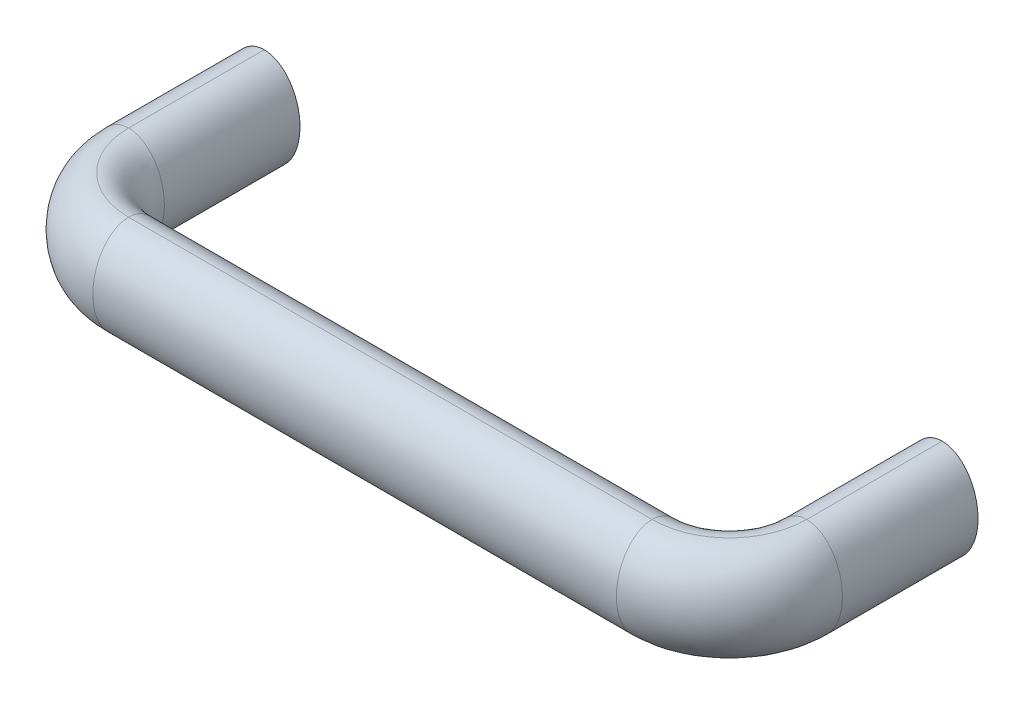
ISO-10303-21;
HEADER;
FILE_DESCRIPTION(('STEP AP214'),'2;1');
FILE_NAME('part.step','',(''),(''),'','','');
FILE_SCHEMA(('AUTOMOTIVE_DESIGN { 1 0 10303 214 1 1 1 1 }'));
ENDSEC;
DATA;
#1=APPLICATION_CONTEXT('core data for automotive mechanical design processes');
#2=APPLICATION_PROTOCOL_DEFINITION('international standard','automotive_design',2000,#1);
#3=PRODUCT_CONTEXT('',#1,'mechanical');
#4=PRODUCT('Part','Part','',(#3));
#5=PRODUCT_RELATED_PRODUCT_CATEGORY('part','',(#4));
#6=PRODUCT_DEFINITION_FORMATION('','',#4);
#7=PRODUCT_DEFINITION_CONTEXT('part definition',#1,'design');
#8=PRODUCT_DEFINITION('design','',#6,#7);
#9=PRODUCT_DEFINITION_SHAPE('','',#8);
#10=(LENGTH_UNIT() NAMED_UNIT(*) SI_UNIT(.MILLI.,.METRE.));
#11=(NAMED_UNIT(*) PLANE_ANGLE_UNIT() SI_UNIT($,.RADIAN.));
#12=(NAMED_UNIT(*) SI_UNIT($,.STERADIAN.) SOLID_ANGLE_UNIT());
#13=UNCERTAINTY_MEASURE_WITH_UNIT(LENGTH_MEASURE(1.E-05),#10,'distance_accuracy_value','');
#14=(GEOMETRIC_REPRESENTATION_CONTEXT(3) GLOBAL_UNCERTAINTY_ASSIGNED_CONTEXT((#13)) GLOBAL_UNIT_ASSIGNED_CONTEXT((#10,
#11,#12)) REPRESENTATION_CONTEXT('',''));
#15=CARTESIAN_POINT('',(0.,0.,0.));
#16=DIRECTION('',(0.,0.,1.));
#17=DIRECTION('',(1.,0.,0.));
#18=AXIS2_PLACEMENT_3D('',#15,#16,#17);
#19=CARTESIAN_POINT('',(0.,0.,0.));
#20=DIRECTION('',(0.,0.,-1.));
#21=DIRECTION('',(0.,1.,0.));
#22=AXIS2_PLACEMENT_3D('',#19,#20,#21);
#23=CONICAL_SURFACE('',#22,3.24999999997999,0.785398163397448);
#24=CARTESIAN_POINT('',(0.,0.,0.249999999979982));
#25=DIRECTION('',(0.,0.,-1.));
#26=DIRECTION('',(0.,1.,0.));
#27=AXIS2_PLACEMENT_3D('',#24,#25,#26);
#28=CIRCLE('',#27,3.);
#29=CARTESIAN_POINT('',(0.,3.,0.249999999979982));
#30=VERTEX_POINT('',#29);
#31=EDGE_CURVE('E17',#30,#30,#28,.F.);
#32=ORIENTED_EDGE('',*,*,#31,.T.);
#33=EDGE_LOOP('',(#32));
#34=FACE_BOUND('',#33,.T.);
#35=CARTESIAN_POINT('',(0.,0.,0.));
#36=DIRECTION('',(0.,0.,-1.));
#37=DIRECTION('',(0.,1.,0.));
#38=AXIS2_PLACEMENT_3D('',#35,#36,#37);
#39=CIRCLE('',#38,3.24999999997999);
#40=CARTESIAN_POINT('',(0.,3.24999999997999,0.));
#41=VERTEX_POINT('',#40);
#42=EDGE_CURVE('E153',#41,#41,#39,.T.);
#43=ORIENTED_EDGE('',*,*,#42,.T.);
#44=EDGE_LOOP('',(#43));
#45=FACE_BOUND('',#44,.T.);
#46=ADVANCED_FACE('F14',(#34,#45),#23,.F.);
#47=CARTESIAN_POINT('',(180.,0.,0.));
#48=DIRECTION('',(0.,0.,-1.));
#49=DIRECTION('',(0.,1.,0.));
#50=AXIS2_PLACEMENT_3D('',#47,#48,#49);
#51=CONICAL_SURFACE('',#50,3.24999999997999,0.785398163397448);
#52=CARTESIAN_POINT('',(180.,0.,0.249999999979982));
#53=DIRECTION('',(0.,0.,-1.));
#54=DIRECTION('',(0.,1.,0.));
#55=AXIS2_PLACEMENT_3D('',#52,#53,#54);
#56=CIRCLE('',#55,3.);
#57=CARTESIAN_POINT('',(180.,3.,0.249999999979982));
#58=VERTEX_POINT('',#57);
#59=EDGE_CURVE('E155',#58,#58,#56,.F.);
#60=ORIENTED_EDGE('',*,*,#59,.T.);
#61=EDGE_LOOP('',(#60));
#62=FACE_BOUND('',#61,.T.);
#63=CARTESIAN_POINT('',(180.,0.,0.));
#64=DIRECTION('',(0.,0.,-1.));
#65=DIRECTION('',(0.,1.,0.));
#66=AXIS2_PLACEMENT_3D('',#63,#64,#65);
#67=CIRCLE('',#66,3.24999999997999);
#68=CARTESIAN_POINT('',(180.,3.24999999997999,0.));
#69=VERTEX_POINT('',#68);
#70=EDGE_CURVE('E72',#69,#69,#67,.T.);
#71=ORIENTED_EDGE('',*,*,#70,.T.);
#72=EDGE_LOOP('',(#71));
#73=FACE_BOUND('',#72,.T.);
#74=ADVANCED_FACE('F389',(#62,#73),#51,.F.);
#75=CARTESIAN_POINT('',(0.,0.,0.));
#76=DIRECTION('',(0.,0.,1.));
#77=DIRECTION('',(0.,-1.,0.));
#78=AXIS2_PLACEMENT_3D('',#75,#76,#77);
#79=PLANE('',#78);
#80=ORIENTED_EDGE('',*,*,#42,.F.);
#81=EDGE_LOOP('',(#80));
#82=FACE_BOUND('',#81,.T.);
#83=CARTESIAN_POINT('',(0.,-13.,0.));
#84=CARTESIAN_POINT('',(-0.10370405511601,-13.0000016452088,0.));
#85=CARTESIAN_POINT('',(-0.207393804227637,-12.9976756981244,0.));
#86=CARTESIAN_POINT('',(-0.414560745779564,-12.9883904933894,0.));
#87=CARTESIAN_POINT('',(-0.518037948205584,-12.9814314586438,0.));
#88=CARTESIAN_POINT('',(-0.827720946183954,-12.9536523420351,0.));
#89=CARTESIAN_POINT('',(-1.03334827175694,-12.9259301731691,0.));
#90=CARTESIAN_POINT('',(-1.43989282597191,-12.8528518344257,0.));
#91=CARTESIAN_POINT('',(-1.64083313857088,-12.8076223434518,0.));
#92=CARTESIAN_POINT('',(-2.03817662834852,-12.7003072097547,0.));
#93=CARTESIAN_POINT('',(-2.23457932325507,-12.6382197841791,0.));
#94=CARTESIAN_POINT('',(-2.62116017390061,-12.4983673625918,0.));
#95=CARTESIAN_POINT('',(-2.81135228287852,-12.4206407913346,0.));
#96=CARTESIAN_POINT('',(-3.18513247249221,-12.2505210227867,0.));
#97=CARTESIAN_POINT('',(-3.36871782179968,-12.1581218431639,0.));
#98=CARTESIAN_POINT('',(-3.72876819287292,-11.9597195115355,0.));
#99=CARTESIAN_POINT('',(-3.90522073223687,-11.8536937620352,0.));
#100=CARTESIAN_POINT('',(-4.25016251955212,-11.6293733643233,0.));
#101=CARTESIAN_POINT('',(-4.41865007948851,-11.5110761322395,0.));
#102=CARTESIAN_POINT('',(-4.8145493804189,-11.2127044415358,0.));
#103=CARTESIAN_POINT('',(-5.03785689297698,-11.0271606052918,0.));
#104=CARTESIAN_POINT('',(-5.46734763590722,-10.6371825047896,0.));
#105=CARTESIAN_POINT('',(-5.67352416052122,-10.4327409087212,0.));
#106=CARTESIAN_POINT('',(-6.06866713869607,-10.0076838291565,0.));
#107=CARTESIAN_POINT('',(-6.25762379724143,-9.78705926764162,0.));
#108=CARTESIAN_POINT('',(-6.61826082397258,-9.33226558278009,0.));
#109=CARTESIAN_POINT('',(-6.78994500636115,-9.09809946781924,0.));
#110=CARTESIAN_POINT('',(-7.16996529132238,-8.53951998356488,0.));
#111=CARTESIAN_POINT('',(-7.37184591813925,-8.21070374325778,0.));
#112=CARTESIAN_POINT('',(-7.74637926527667,-7.53739509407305,0.));
#113=CARTESIAN_POINT('',(-7.9190616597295,-7.19291905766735,0.));
#114=CARTESIAN_POINT('',(-8.23777473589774,-6.48832470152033,0.));
#115=CARTESIAN_POINT('',(-8.38356346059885,-6.1280973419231,0.));
#116=CARTESIAN_POINT('',(-8.64757633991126,-5.39757283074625,0.));
#117=CARTESIAN_POINT('',(-8.76578993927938,-5.02727188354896,0.));
#118=CARTESIAN_POINT('',(-8.97563498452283,-4.27817663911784,0.));
#119=CARTESIAN_POINT('',(-9.06719481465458,-3.89936235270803,0.));
#120=CARTESIAN_POINT('',(-9.223923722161,-3.13636922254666,0.));
#121=CARTESIAN_POINT('',(-9.28909437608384,-2.75219070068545,0.));
#122=CARTESIAN_POINT('',(-9.40169645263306,-1.91979237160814,0.));
#123=CARTESIAN_POINT('',(-9.444744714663,-1.47097543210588,0.));
#124=CARTESIAN_POINT('',(-9.49655008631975,-0.571299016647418,0.));
#125=CARTESIAN_POINT('',(-9.50530008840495,-0.120439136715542,0.));
#126=CARTESIAN_POINT('',(-9.48859034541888,0.779737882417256,0.));
#127=CARTESIAN_POINT('',(-9.46320011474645,1.22905629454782,0.));
#128=CARTESIAN_POINT('',(-9.37811003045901,2.12428232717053,0.));
#129=CARTESIAN_POINT('',(-9.31842213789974,2.57019108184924,0.));
#130=CARTESIAN_POINT('',(-9.15762533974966,3.49370155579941,0.));
#131=CARTESIAN_POINT('',(-9.05342310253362,3.97077013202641,0.));
#132=CARTESIAN_POINT('',(-8.80270918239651,4.91433412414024,0.));
#133=CARTESIAN_POINT('',(-8.65615012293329,5.38081706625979,0.));
#134=CARTESIAN_POINT('',(-8.35114563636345,6.21100389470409,0.));
#135=CARTESIAN_POINT('',(-8.200187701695,6.57746351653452,0.));
#136=CARTESIAN_POINT('',(-7.86847223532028,7.29687971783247,0.));
#137=CARTESIAN_POINT('',(-7.68770410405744,7.64983143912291,0.));
#138=CARTESIAN_POINT('',(-7.29558770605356,8.3379282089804,0.));
#139=CARTESIAN_POINT('',(-7.08427388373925,8.67309274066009,0.));
#140=CARTESIAN_POINT('',(-6.63011203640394,9.32128606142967,0.));
#141=CARTESIAN_POINT('',(-6.38726664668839,9.63431669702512,0.));
#142=CARTESIAN_POINT('',(-5.79567080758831,10.3176696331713,0.));
#143=CARTESIAN_POINT('',(-5.43639726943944,10.6791397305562,0.));
#144=CARTESIAN_POINT('',(-4.8587773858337,11.1754034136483,0.));
#145=CARTESIAN_POINT('',(-4.6598380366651,11.3331354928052,0.));
#146=CARTESIAN_POINT('',(-4.24934295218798,11.6313384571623,0.));
#147=CARTESIAN_POINT('',(-4.03778925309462,11.7718121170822,0.));
#148=CARTESIAN_POINT('',(-3.63727837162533,12.0125400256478,0.));
#149=CARTESIAN_POINT('',(-3.45002924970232,12.1156424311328,0.));
#150=CARTESIAN_POINT('',(-3.06792288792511,12.3066022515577,0.));
#151=CARTESIAN_POINT('',(-2.87306710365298,12.3944625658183,0.));
#152=CARTESIAN_POINT('',(-2.47696779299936,12.5535130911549,0.));
#153=CARTESIAN_POINT('',(-2.27573388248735,12.6247271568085,0.));
#154=CARTESIAN_POINT('',(-1.86792463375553,12.7494337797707,0.));
#155=CARTESIAN_POINT('',(-1.66135116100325,12.8029324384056,0.));
#156=CARTESIAN_POINT('',(-1.21422783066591,12.8976013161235,0.));
#157=CARTESIAN_POINT('',(-0.973055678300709,12.9359012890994,0.));
#158=CARTESIAN_POINT('',(-0.609314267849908,12.9743043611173,0.));
#159=CARTESIAN_POINT('',(-0.48768026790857,12.9839309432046,0.));
#160=CARTESIAN_POINT('',(-0.244039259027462,12.9967810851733,0.));
#161=CARTESIAN_POINT('',(-0.122032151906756,13.0000027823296,0.));
#162=CARTESIAN_POINT('',(0.,13.,0.));
#163=B_SPLINE_CURVE_WITH_KNOTS('',3,(#83,#84,#85,#86,#87,#88,#89,#90,#91,#92,#93,#94,#95,#96,
#97,#98,#99,#100,#101,#102,#103,#104,#105,#106,#107,#108,#109,#110,#111,#112,#113,#114,#115,
#116,#117,#118,#119,#120,#121,#122,#123,#124,#125,#126,#127,#128,#129,#130,#131,#132,#133,#134,
#135,#136,#137,#138,#139,#140,#141,#142,#143,#144,#145,#146,#147,#148,#149,#150,#151,#152,#153,
#154,#155,#156,#157,#158,#159,#160,#161,#162),.UNSPECIFIED.,.F.,.F.,(4,2,2,2,2,2,2,2,2,2,2,2,2,
2,2,2,2,2,2,2,2,2,2,2,2,2,2,2,2,2,2,2,2,2,2,2,2,2,2,4),(0.,0.311057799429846,0.622100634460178,
1.24367772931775,1.86083886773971,2.47806530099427,3.09379335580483,3.70977310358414,
4.32678786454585,4.94393280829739,5.81364209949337,6.68369024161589,7.55423023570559,
8.42457756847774,9.58047710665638,10.735194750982,11.8998422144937,13.0649347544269,
14.2331294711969,15.4012543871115,16.7525213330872,18.1040682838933,19.4528674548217,
20.8011965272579,22.2642970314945,23.7290404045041,24.9168225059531,26.1050278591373,
27.2919036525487,28.47868031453,30.0012695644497,30.7622002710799,31.5230084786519,
32.163659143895,32.8041878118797,33.4437928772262,34.0831774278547,34.8143011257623,
35.1801993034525,35.5462038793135),.UNSPECIFIED.);
#164=CARTESIAN_POINT('',(0.,-13.,0.));
#165=VERTEX_POINT('',#164);
#166=CARTESIAN_POINT('',(0.,13.,0.));
#167=VERTEX_POINT('',#166);
#168=EDGE_CURVE('E66',#165,#167,#163,.T.);
#169=ORIENTED_EDGE('',*,*,#168,.T.);
#170=CARTESIAN_POINT('',(0.,13.,0.));
#171=CARTESIAN_POINT('',(0.10370405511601,13.0000016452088,0.));
#172=CARTESIAN_POINT('',(0.207393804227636,12.9976756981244,0.));
#173=CARTESIAN_POINT('',(0.414560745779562,12.9883904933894,0.));
#174=CARTESIAN_POINT('',(0.518037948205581,12.9814314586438,0.));
#175=CARTESIAN_POINT('',(0.82772094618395,12.9536523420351,0.));
#176=CARTESIAN_POINT('',(1.03334827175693,12.9259301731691,0.));
#177=CARTESIAN_POINT('',(1.4398928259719,12.8528518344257,0.));
#178=CARTESIAN_POINT('',(1.64083313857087,12.8076223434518,0.));
#179=CARTESIAN_POINT('',(2.03817662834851,12.7003072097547,0.));
#180=CARTESIAN_POINT('',(2.23457932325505,12.6382197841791,0.));
#181=CARTESIAN_POINT('',(2.62116017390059,12.4983673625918,0.));
#182=CARTESIAN_POINT('',(2.8113522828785,12.4206407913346,0.));
#183=CARTESIAN_POINT('',(3.18513247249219,12.2505210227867,0.));
#184=CARTESIAN_POINT('',(3.36871782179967,12.1581218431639,0.));
#185=CARTESIAN_POINT('',(3.7287681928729,11.9597195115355,0.));
#186=CARTESIAN_POINT('',(3.90522073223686,11.8536937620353,0.));
#187=CARTESIAN_POINT('',(4.2501625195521,11.6293733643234,0.));
#188=CARTESIAN_POINT('',(4.41865007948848,11.5110761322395,0.));
#189=CARTESIAN_POINT('',(4.81454938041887,11.2127044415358,0.));
#190=CARTESIAN_POINT('',(5.03785689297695,11.0271606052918,0.));
#191=CARTESIAN_POINT('',(5.4673476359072,10.6371825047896,0.));
#192=CARTESIAN_POINT('',(5.6735241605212,10.4327409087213,0.));
#193=CARTESIAN_POINT('',(6.06866713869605,10.0076838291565,0.));
#194=CARTESIAN_POINT('',(6.25762379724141,9.78705926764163,0.));
#195=CARTESIAN_POINT('',(6.61826082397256,9.3322655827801,0.));
#196=CARTESIAN_POINT('',(6.78994500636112,9.09809946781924,0.));
#197=CARTESIAN_POINT('',(7.16996529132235,8.53951998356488,0.));
#198=CARTESIAN_POINT('',(7.37184591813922,8.21070374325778,0.));
#199=CARTESIAN_POINT('',(7.74637926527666,7.53739509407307,0.));
#200=CARTESIAN_POINT('',(7.9190616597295,7.19291905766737,0.));
#201=CARTESIAN_POINT('',(8.23777473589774,6.48832470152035,0.));
#202=CARTESIAN_POINT('',(8.38356346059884,6.12809734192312,0.));
#203=CARTESIAN_POINT('',(8.64757633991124,5.39757283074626,0.));
#204=CARTESIAN_POINT('',(8.76578993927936,5.02727188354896,0.));
#205=CARTESIAN_POINT('',(8.97563498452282,4.27817663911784,0.));
#206=CARTESIAN_POINT('',(9.06719481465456,3.89936235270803,0.));
#207=CARTESIAN_POINT('',(9.22392372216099,3.13636922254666,0.));
#208=CARTESIAN_POINT('',(9.28909437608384,2.75219070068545,0.));
#209=CARTESIAN_POINT('',(9.40169645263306,1.91979237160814,0.));
#210=CARTESIAN_POINT('',(9.44474471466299,1.47097543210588,0.));
#211=CARTESIAN_POINT('',(9.49655008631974,0.571299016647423,0.));
#212=CARTESIAN_POINT('',(9.50530008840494,0.120439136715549,0.));
#213=CARTESIAN_POINT('',(9.48859034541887,-0.779737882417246,0.));
#214=CARTESIAN_POINT('',(9.46320011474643,-1.22905629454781,0.));
#215=CARTESIAN_POINT('',(9.37811003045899,-2.12428232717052,0.));
#216=CARTESIAN_POINT('',(9.31842213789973,-2.57019108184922,0.));
#217=CARTESIAN_POINT('',(9.15762533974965,-3.49370155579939,0.));
#218=CARTESIAN_POINT('',(9.0534231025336,-3.97077013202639,0.));
#219=CARTESIAN_POINT('',(8.80270918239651,-4.91433412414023,0.));
#220=CARTESIAN_POINT('',(8.65615012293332,-5.38081706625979,0.));
#221=CARTESIAN_POINT('',(8.35114563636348,-6.21100389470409,0.));
#222=CARTESIAN_POINT('',(8.20018770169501,-6.57746351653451,0.));
#223=CARTESIAN_POINT('',(7.86847223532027,-7.29687971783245,0.));
#224=CARTESIAN_POINT('',(7.68770410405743,-7.6498314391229,0.));
#225=CARTESIAN_POINT('',(7.29558770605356,-8.33792820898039,0.));
#226=CARTESIAN_POINT('',(7.08427388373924,-8.67309274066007,0.));
#227=CARTESIAN_POINT('',(6.63011203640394,-9.32128606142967,0.));
#228=CARTESIAN_POINT('',(6.38726664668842,-9.63431669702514,0.));
#229=CARTESIAN_POINT('',(5.79567080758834,-10.3176696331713,0.));
#230=CARTESIAN_POINT('',(5.43639726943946,-10.6791397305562,0.));
#231=CARTESIAN_POINT('',(4.8587773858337,-11.1754034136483,0.));
#232=CARTESIAN_POINT('',(4.65983803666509,-11.3331354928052,0.));
#233=CARTESIAN_POINT('',(4.24934295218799,-11.6313384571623,0.));
#234=CARTESIAN_POINT('',(4.03778925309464,-11.7718121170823,0.));
#235=CARTESIAN_POINT('',(3.63727837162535,-12.0125400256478,0.));
#236=CARTESIAN_POINT('',(3.45002924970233,-12.1156424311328,0.));
#237=CARTESIAN_POINT('',(3.0679228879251,-12.3066022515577,0.));
#238=CARTESIAN_POINT('',(2.87306710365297,-12.3944625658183,0.));
#239=CARTESIAN_POINT('',(2.47696779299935,-12.5535130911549,0.));
#240=CARTESIAN_POINT('',(2.27573388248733,-12.6247271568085,0.));
#241=CARTESIAN_POINT('',(1.86792463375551,-12.7494337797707,0.));
#242=CARTESIAN_POINT('',(1.66135116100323,-12.8029324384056,0.));
#243=CARTESIAN_POINT('',(1.21422783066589,-12.8976013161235,0.));
#244=CARTESIAN_POINT('',(0.973055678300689,-12.9359012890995,0.));
#245=CARTESIAN_POINT('',(0.609314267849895,-12.9743043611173,0.));
#246=CARTESIAN_POINT('',(0.487680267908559,-12.9839309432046,0.));
#247=CARTESIAN_POINT('',(0.244039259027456,-12.9967810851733,0.));
#248=CARTESIAN_POINT('',(0.122032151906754,-13.0000027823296,0.));
#249=CARTESIAN_POINT('',(0.,-13.,0.));
#250=B_SPLINE_CURVE_WITH_KNOTS('',3,(#170,#171,#172,#173,#174,#175,#176,#177,#178,#179,#180,
#181,#182,#183,#184,#185,#186,#187,#188,#189,#190,#191,#192,#193,#194,#195,#196,#197,#198,#199,
#200,#201,#202,#203,#204,#205,#206,#207,#208,#209,#210,#211,#212,#213,#214,#215,#216,#217,#218,
#219,#220,#221,#222,#223,#224,#225,#226,#227,#228,#229,#230,#231,#232,#233,#234,#235,#236,#237,
#238,#239,#240,#241,#242,#243,#244,#245,#246,#247,#248,#249),.UNSPECIFIED.,.F.,.F.,(4,2,2,2,2,2,
2,2,2,2,2,2,2,2,2,2,2,2,2,2,2,2,2,2,2,2,2,2,2,2,2,2,2,2,2,2,2,2,2,4),(0.,0.311057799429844,
0.622100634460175,1.24367772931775,1.8608388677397,2.47806530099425,3.09379335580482,
3.70977310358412,4.32678786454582,4.94393280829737,5.81364209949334,6.68369024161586,
7.55423023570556,8.42457756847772,9.58047710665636,10.735194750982,11.8998422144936,
13.0649347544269,14.2331294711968,15.4012543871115,16.7525213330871,18.1040682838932,
19.4528674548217,20.8011965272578,22.2642970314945,23.7290404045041,24.9168225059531,
26.1050278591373,27.2919036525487,28.47868031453,30.0012695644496,30.7622002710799,
31.5230084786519,32.163659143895,32.8041878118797,33.4437928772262,34.0831774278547,
34.8143011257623,35.1801993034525,35.5462038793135),.UNSPECIFIED.);
#251=EDGE_CURVE('E64',#167,#165,#250,.T.);
#252=ORIENTED_EDGE('',*,*,#251,.T.);
#253=EDGE_LOOP('',(#169,#252));
#254=FACE_BOUND('',#253,.T.);
#255=ADVANCED_FACE('F68',(#82,#254),#79,.F.);
#256=CARTESIAN_POINT('',(180.,0.,0.));
#257=DIRECTION('',(0.,0.,1.));
#258=DIRECTION('',(0.,-1.,0.));
#259=AXIS2_PLACEMENT_3D('',#256,#257,#258);
#260=PLANE('',#259);
#261=ORIENTED_EDGE('',*,*,#70,.F.);
#262=EDGE_LOOP('',(#261));
#263=FACE_BOUND('',#262,.T.);
#264=CARTESIAN_POINT('',(180.,-13.,0.));
#265=CARTESIAN_POINT('',(180.103704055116,-13.0000016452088,0.));
#266=CARTESIAN_POINT('',(180.207393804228,-12.9976756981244,0.));
#267=CARTESIAN_POINT('',(180.41456074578,-12.9883904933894,0.));
#268=CARTESIAN_POINT('',(180.518037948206,-12.9814314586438,0.));
#269=CARTESIAN_POINT('',(180.827720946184,-12.9536523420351,0.));
#270=CARTESIAN_POINT('',(181.033348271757,-12.9259301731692,0.));
#271=CARTESIAN_POINT('',(181.439892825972,-12.8528518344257,0.));
#272=CARTESIAN_POINT('',(181.640833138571,-12.8076223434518,0.));
#273=CARTESIAN_POINT('',(182.038176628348,-12.7003072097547,0.));
#274=CARTESIAN_POINT('',(182.234579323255,-12.6382197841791,0.));
#275=CARTESIAN_POINT('',(182.621160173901,-12.4983673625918,0.));
#276=CARTESIAN_POINT('',(182.811352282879,-12.4206407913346,0.));
#277=CARTESIAN_POINT('',(183.185132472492,-12.2505210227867,0.));
#278=CARTESIAN_POINT('',(183.3687178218,-12.1581218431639,0.));
#279=CARTESIAN_POINT('',(183.728768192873,-11.9597195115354,0.));
#280=CARTESIAN_POINT('',(183.905220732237,-11.8536937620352,0.));
#281=CARTESIAN_POINT('',(184.250162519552,-11.6293733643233,0.));
#282=CARTESIAN_POINT('',(184.418650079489,-11.5110761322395,0.));
#283=CARTESIAN_POINT('',(184.814549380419,-11.2127044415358,0.));
#284=CARTESIAN_POINT('',(185.037856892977,-11.0271606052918,0.));
#285=CARTESIAN_POINT('',(185.467347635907,-10.6371825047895,0.));
#286=CARTESIAN_POINT('',(185.673524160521,-10.4327409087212,0.));
#287=CARTESIAN_POINT('',(186.068667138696,-10.0076838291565,0.));
#288=CARTESIAN_POINT('',(186.257623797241,-9.7870592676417,0.));
#289=CARTESIAN_POINT('',(186.618260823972,-9.33226558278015,0.));
#290=CARTESIAN_POINT('',(186.789945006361,-9.09809946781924,0.));
#291=CARTESIAN_POINT('',(187.169965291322,-8.53951998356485,0.));
#292=CARTESIAN_POINT('',(187.371845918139,-8.21070374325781,0.));
#293=CARTESIAN_POINT('',(187.746379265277,-7.5373950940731,0.));
#294=CARTESIAN_POINT('',(187.91906165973,-7.19291905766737,0.));
#295=CARTESIAN_POINT('',(188.237774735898,-6.48832470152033,0.));
#296=CARTESIAN_POINT('',(188.383563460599,-6.12809734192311,0.));
#297=CARTESIAN_POINT('',(188.647576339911,-5.39757283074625,0.));
#298=CARTESIAN_POINT('',(188.765789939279,-5.02727188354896,0.));
#299=CARTESIAN_POINT('',(188.975634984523,-4.27817663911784,0.));
#300=CARTESIAN_POINT('',(189.067194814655,-3.89936235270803,0.));
#301=CARTESIAN_POINT('',(189.223923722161,-3.13636922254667,0.));
#302=CARTESIAN_POINT('',(189.289094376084,-2.75219070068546,0.));
#303=CARTESIAN_POINT('',(189.401696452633,-1.91979237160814,0.));
#304=CARTESIAN_POINT('',(189.444744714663,-1.47097543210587,0.));
#305=CARTESIAN_POINT('',(189.49655008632,-0.571299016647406,0.));
#306=CARTESIAN_POINT('',(189.505300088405,-0.120439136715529,0.));
#307=CARTESIAN_POINT('',(189.488590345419,0.779737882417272,0.));
#308=CARTESIAN_POINT('',(189.463200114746,1.22905629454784,0.));
#309=CARTESIAN_POINT('',(189.378110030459,2.12428232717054,0.));
#310=CARTESIAN_POINT('',(189.3184221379,2.57019108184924,0.));
#311=CARTESIAN_POINT('',(189.15762533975,3.49370155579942,0.));
#312=CARTESIAN_POINT('',(189.053423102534,3.97077013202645,0.));
#313=CARTESIAN_POINT('',(188.802709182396,4.91433412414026,0.));
#314=CARTESIAN_POINT('',(188.656150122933,5.38081706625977,0.));
#315=CARTESIAN_POINT('',(188.351145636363,6.21100389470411,0.));
#316=CARTESIAN_POINT('',(188.200187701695,6.5774635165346,0.));
#317=CARTESIAN_POINT('',(187.86847223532,7.29687971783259,0.));
#318=CARTESIAN_POINT('',(187.687704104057,7.64983143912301,0.));
#319=CARTESIAN_POINT('',(187.295587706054,8.33792820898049,0.));
#320=CARTESIAN_POINT('',(187.084273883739,8.67309274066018,0.));
#321=CARTESIAN_POINT('',(186.630112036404,9.32128606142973,0.));
#322=CARTESIAN_POINT('',(186.387266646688,9.63431669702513,0.));
#323=CARTESIAN_POINT('',(185.795670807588,10.3176696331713,0.));
#324=CARTESIAN_POINT('',(185.436397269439,10.6791397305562,0.));
#325=CARTESIAN_POINT('',(184.858777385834,11.1754034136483,0.));
#326=CARTESIAN_POINT('',(184.659838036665,11.3331354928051,0.));
#327=CARTESIAN_POINT('',(184.249342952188,11.6313384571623,0.));
#328=CARTESIAN_POINT('',(184.037789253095,11.7718121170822,0.));
#329=CARTESIAN_POINT('',(183.637278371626,12.0125400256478,0.));
#330=CARTESIAN_POINT('',(183.450029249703,12.1156424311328,0.));
#331=CARTESIAN_POINT('',(183.067922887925,12.3066022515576,0.));
#332=CARTESIAN_POINT('',(182.873067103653,12.3944625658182,0.));
#333=CARTESIAN_POINT('',(182.476967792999,12.5535130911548,0.));
#334=CARTESIAN_POINT('',(182.275733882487,12.6247271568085,0.));
#335=CARTESIAN_POINT('',(181.867924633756,12.7494337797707,0.));
#336=CARTESIAN_POINT('',(181.661351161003,12.8029324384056,0.));
#337=CARTESIAN_POINT('',(181.214227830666,12.8976013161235,0.));
#338=CARTESIAN_POINT('',(180.973055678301,12.9359012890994,0.));
#339=CARTESIAN_POINT('',(180.60931426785,12.9743043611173,0.));
#340=CARTESIAN_POINT('',(180.487680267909,12.9839309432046,0.));
#341=CARTESIAN_POINT('',(180.244039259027,12.9967810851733,0.));
#342=CARTESIAN_POINT('',(180.122032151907,13.0000027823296,0.));
#343=CARTESIAN_POINT('',(180.,13.,0.));
#344=B_SPLINE_CURVE_WITH_KNOTS('',3,(#264,#265,#266,#267,#268,#269,#270,#271,#272,#273,#274,
#275,#276,#277,#278,#279,#280,#281,#282,#283,#284,#285,#286,#287,#288,#289,#290,#291,#292,#293,
#294,#295,#296,#297,#298,#299,#300,#301,#302,#303,#304,#305,#306,#307,#308,#309,#310,#311,#312,
#313,#314,#315,#316,#317,#318,#319,#320,#321,#322,#323,#324,#325,#326,#327,#328,#329,#330,#331,
#332,#333,#334,#335,#336,#337,#338,#339,#340,#341,#342,#343),.UNSPECIFIED.,.F.,.F.,(4,2,2,2,2,2,
2,2,2,2,2,2,2,2,2,2,2,2,2,2,2,2,2,2,2,2,2,2,2,2,2,2,2,2,2,2,2,2,2,4),(0.,0.311057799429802,
0.62210063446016,1.24367772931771,1.86083886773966,2.47806530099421,3.09379335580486,
3.70977310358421,4.32678786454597,4.94393280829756,5.81364209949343,6.68369024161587,
7.55423023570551,8.42457756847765,9.58047710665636,10.735194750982,11.8998422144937,
13.0649347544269,14.2331294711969,15.4012543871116,16.7525213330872,18.1040682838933,
19.4528674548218,20.8011965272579,22.2642970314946,23.7290404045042,24.9168225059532,
26.1050278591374,27.2919036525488,28.4786803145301,30.0012695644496,30.7622002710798,
31.5230084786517,32.1636591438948,32.8041878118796,33.4437928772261,34.0831774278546,
34.8143011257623,35.1801993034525,35.5462038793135),.UNSPECIFIED.);
#345=CARTESIAN_POINT('',(180.,-13.,0.));
#346=VERTEX_POINT('',#345);
#347=CARTESIAN_POINT('',(180.,13.,0.));
#348=VERTEX_POINT('',#347);
#349=EDGE_CURVE('E71',#346,#348,#344,.T.);
#350=ORIENTED_EDGE('',*,*,#349,.F.);
#351=CARTESIAN_POINT('',(180.,13.,0.));
#352=CARTESIAN_POINT('',(179.896295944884,13.0000016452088,0.));
#353=CARTESIAN_POINT('',(179.792606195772,12.9976756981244,0.));
#354=CARTESIAN_POINT('',(179.58543925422,12.9883904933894,0.));
#355=CARTESIAN_POINT('',(179.481962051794,12.9814314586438,0.));
#356=CARTESIAN_POINT('',(179.172279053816,12.9536523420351,0.));
#357=CARTESIAN_POINT('',(178.966651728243,12.9259301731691,0.));
#358=CARTESIAN_POINT('',(178.560107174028,12.8528518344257,0.));
#359=CARTESIAN_POINT('',(178.359166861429,12.8076223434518,0.));
#360=CARTESIAN_POINT('',(177.961823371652,12.7003072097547,0.));
#361=CARTESIAN_POINT('',(177.765420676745,12.6382197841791,0.));
#362=CARTESIAN_POINT('',(177.378839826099,12.4983673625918,0.));
#363=CARTESIAN_POINT('',(177.188647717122,12.4206407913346,0.));
#364=CARTESIAN_POINT('',(176.814867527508,12.2505210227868,0.));
#365=CARTESIAN_POINT('',(176.6312821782,12.1581218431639,0.));
#366=CARTESIAN_POINT('',(176.271231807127,11.9597195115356,0.));
#367=CARTESIAN_POINT('',(176.094779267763,11.8536937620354,0.));
#368=CARTESIAN_POINT('',(175.749837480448,11.6293733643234,0.));
#369=CARTESIAN_POINT('',(175.581349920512,11.5110761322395,0.));
#370=CARTESIAN_POINT('',(175.185450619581,11.2127044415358,0.));
#371=CARTESIAN_POINT('',(174.962143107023,11.0271606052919,0.));
#372=CARTESIAN_POINT('',(174.532652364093,10.6371825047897,0.));
#373=CARTESIAN_POINT('',(174.326475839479,10.4327409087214,0.));
#374=CARTESIAN_POINT('',(173.931332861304,10.0076838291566,0.));
#375=CARTESIAN_POINT('',(173.742376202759,9.78705926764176,0.));
#376=CARTESIAN_POINT('',(173.381739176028,9.33226558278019,0.));
#377=CARTESIAN_POINT('',(173.210054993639,9.09809946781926,0.));
#378=CARTESIAN_POINT('',(172.830034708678,8.53951998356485,0.));
#379=CARTESIAN_POINT('',(172.628154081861,8.2107037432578,0.));
#380=CARTESIAN_POINT('',(172.253620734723,7.53739509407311,0.));
#381=CARTESIAN_POINT('',(172.08093834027,7.1929190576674,0.));
#382=CARTESIAN_POINT('',(171.762225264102,6.48832470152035,0.));
#383=CARTESIAN_POINT('',(171.616436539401,6.12809734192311,0.));
#384=CARTESIAN_POINT('',(171.352423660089,5.39757283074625,0.));
#385=CARTESIAN_POINT('',(171.234210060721,5.02727188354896,0.));
#386=CARTESIAN_POINT('',(171.024365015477,4.27817663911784,0.));
#387=CARTESIAN_POINT('',(170.932805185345,3.89936235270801,0.));
#388=CARTESIAN_POINT('',(170.776076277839,3.13636922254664,0.));
#389=CARTESIAN_POINT('',(170.710905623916,2.75219070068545,0.));
#390=CARTESIAN_POINT('',(170.598303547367,1.91979237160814,0.));
#391=CARTESIAN_POINT('',(170.555255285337,1.47097543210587,0.));
#392=CARTESIAN_POINT('',(170.50344991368,0.571299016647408,0.));
#393=CARTESIAN_POINT('',(170.494699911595,0.120439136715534,0.));
#394=CARTESIAN_POINT('',(170.511409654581,-0.779737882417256,0.));
#395=CARTESIAN_POINT('',(170.536799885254,-1.22905629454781,0.));
#396=CARTESIAN_POINT('',(170.621889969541,-2.12428232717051,0.));
#397=CARTESIAN_POINT('',(170.6815778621,-2.57019108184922,0.));
#398=CARTESIAN_POINT('',(170.84237466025,-3.49370155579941,0.));
#399=CARTESIAN_POINT('',(170.946576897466,-3.97077013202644,0.));
#400=CARTESIAN_POINT('',(171.197290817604,-4.91433412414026,0.));
#401=CARTESIAN_POINT('',(171.343849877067,-5.38081706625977,0.));
#402=CARTESIAN_POINT('',(171.648854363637,-6.21100389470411,0.));
#403=CARTESIAN_POINT('',(171.799812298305,-6.57746351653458,0.));
#404=CARTESIAN_POINT('',(172.13152776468,-7.29687971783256,0.));
#405=CARTESIAN_POINT('',(172.312295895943,-7.64983143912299,0.));
#406=CARTESIAN_POINT('',(172.704412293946,-8.33792820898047,0.));
#407=CARTESIAN_POINT('',(172.915726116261,-8.67309274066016,0.));
#408=CARTESIAN_POINT('',(173.369887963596,-9.32128606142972,0.));
#409=CARTESIAN_POINT('',(173.612733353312,-9.63431669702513,0.));
#410=CARTESIAN_POINT('',(174.204329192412,-10.3176696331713,0.));
#411=CARTESIAN_POINT('',(174.563602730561,-10.6791397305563,0.));
#412=CARTESIAN_POINT('',(175.141222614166,-11.1754034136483,0.));
#413=CARTESIAN_POINT('',(175.340161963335,-11.3331354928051,0.));
#414=CARTESIAN_POINT('',(175.750657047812,-11.6313384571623,0.));
#415=CARTESIAN_POINT('',(175.962210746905,-11.7718121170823,0.));
#416=CARTESIAN_POINT('',(176.362721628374,-12.0125400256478,0.));
#417=CARTESIAN_POINT('',(176.549970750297,-12.1156424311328,0.));
#418=CARTESIAN_POINT('',(176.932077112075,-12.3066022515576,0.));
#419=CARTESIAN_POINT('',(177.126932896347,-12.3944625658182,0.));
#420=CARTESIAN_POINT('',(177.523032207,-12.5535130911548,0.));
#421=CARTESIAN_POINT('',(177.724266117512,-12.6247271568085,0.));
#422=CARTESIAN_POINT('',(178.132075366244,-12.7494337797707,0.));
#423=CARTESIAN_POINT('',(178.338648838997,-12.8029324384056,0.));
#424=CARTESIAN_POINT('',(178.785772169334,-12.8976013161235,0.));
#425=CARTESIAN_POINT('',(179.026944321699,-12.9359012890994,0.));
#426=CARTESIAN_POINT('',(179.39068573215,-12.9743043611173,0.));
#427=CARTESIAN_POINT('',(179.512319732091,-12.9839309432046,0.));
#428=CARTESIAN_POINT('',(179.755960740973,-12.9967810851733,0.));
#429=CARTESIAN_POINT('',(179.877967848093,-13.0000027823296,0.));
#430=CARTESIAN_POINT('',(180.,-13.,0.));
#431=B_SPLINE_CURVE_WITH_KNOTS('',3,(#351,#352,#353,#354,#355,#356,#357,#358,#359,#360,#361,
#362,#363,#364,#365,#366,#367,#368,#369,#370,#371,#372,#373,#374,#375,#376,#377,#378,#379,#380,
#381,#382,#383,#384,#385,#386,#387,#388,#389,#390,#391,#392,#393,#394,#395,#396,#397,#398,#399,
#400,#401,#402,#403,#404,#405,#406,#407,#408,#409,#410,#411,#412,#413,#414,#415,#416,#417,#418,
#419,#420,#421,#422,#423,#424,#425,#426,#427,#428,#429,#430),.UNSPECIFIED.,.F.,.F.,(4,2,2,2,2,2,
2,2,2,2,2,2,2,2,2,2,2,2,2,2,2,2,2,2,2,2,2,2,2,2,2,2,2,2,2,2,2,2,2,4),(0.,0.31105779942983,
0.622100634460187,1.24367772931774,1.86083886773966,2.47806530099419,3.09379335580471,
3.70977310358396,4.32678786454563,4.94393280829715,5.81364209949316,6.68369024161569,
7.5542302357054,8.4245775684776,9.5804771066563,10.735194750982,11.8998422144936,
13.0649347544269,14.2331294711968,15.4012543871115,16.7525213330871,18.1040682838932,
19.4528674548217,20.8011965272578,22.2642970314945,23.7290404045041,24.9168225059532,
26.1050278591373,27.2919036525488,28.4786803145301,30.0012695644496,30.7622002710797,
31.5230084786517,32.1636591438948,32.8041878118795,33.443792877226,34.0831774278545,
34.8143011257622,35.1801993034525,35.5462038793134),.UNSPECIFIED.);
#432=EDGE_CURVE('E96',#348,#346,#431,.T.);
#433=ORIENTED_EDGE('',*,*,#432,.F.);
#434=EDGE_LOOP('',(#350,#433));
#435=FACE_BOUND('',#434,.T.);
#436=ADVANCED_FACE('F139',(#263,#435),#260,.F.);
#437=CARTESIAN_POINT('',(0.,13.,36.));
#438=CARTESIAN_POINT('',(0.,13.,0.));
#439=CARTESIAN_POINT('',(-19.,13.,36.));
#440=CARTESIAN_POINT('',(-19.,13.,0.));
#441=CARTESIAN_POINT('',(-19.,-13.,36.));
#442=CARTESIAN_POINT('',(-19.,-13.,0.));
#443=CARTESIAN_POINT('',(0.,-13.,36.));
#444=CARTESIAN_POINT('',(0.,-13.,0.));
#445=(BOUNDED_SURFACE() B_SPLINE_SURFACE(3,1,((#437,#438),(#439,#440),(#441,#442),(#443,#444)),
.UNSPECIFIED.,.F.,.F.,.F.) B_SPLINE_SURFACE_WITH_KNOTS((4,4),(2,2),(0.,1.),(0.,1.),
.UNSPECIFIED.) GEOMETRIC_REPRESENTATION_ITEM() RATIONAL_B_SPLINE_SURFACE(((1.,1.),
(0.333333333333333,0.333333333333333),(0.333333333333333,0.333333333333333),(1.,1.))) REPRESENTATION_ITEM('') SURFACE());
#446=DIRECTION('',(0.,0.,-1.));
#447=VECTOR('',#446,1.);
#448=CARTESIAN_POINT('',(0.,13.,18.));
#449=LINE('',#448,#447);
#450=CARTESIAN_POINT('',(0.,13.,36.));
#451=VERTEX_POINT('',#450);
#452=EDGE_CURVE('E75',#451,#167,#449,.T.);
#453=DIRECTION('',(0.,0.,1.));
#454=VECTOR('',#453,1.);
#455=CARTESIAN_POINT('',(0.,-13.,18.));
#456=LINE('',#455,#454);
#457=CARTESIAN_POINT('',(0.,-13.,36.));
#458=VERTEX_POINT('',#457);
#459=EDGE_CURVE('E83',#165,#458,#456,.T.);
#460=CARTESIAN_POINT('',(0.,13.,36.));
#461=CARTESIAN_POINT('',(-19.,13.,36.0000000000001));
#462=CARTESIAN_POINT('',(-19.,-13.,36.0000000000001));
#463=CARTESIAN_POINT('',(0.,-13.,36.));
#464=(BOUNDED_CURVE() B_SPLINE_CURVE(3,(#460,#461,#462,#463),.UNSPECIFIED.,.F.,
.F.) B_SPLINE_CURVE_WITH_KNOTS((4,4),(0.,1.),
.UNSPECIFIED.) CURVE() GEOMETRIC_REPRESENTATION_ITEM() RATIONAL_B_SPLINE_CURVE((1.,
0.333333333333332,0.333333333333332,1.)) REPRESENTATION_ITEM(''));
#465=EDGE_CURVE('E78',#451,#458,#464,.T.);
#466=ORIENTED_EDGE('',*,*,#452,.T.);
#467=ORIENTED_EDGE('',*,*,#168,.F.);
#468=ORIENTED_EDGE('',*,*,#459,.T.);
#469=ORIENTED_EDGE('',*,*,#465,.F.);
#470=EDGE_LOOP('',(#466,#467,#468,#469));
#471=FACE_BOUND('',#470,.T.);
#472=ADVANCED_FACE('F76',(#471),#445,.F.);
#473=CARTESIAN_POINT('',(180.,13.,36.));
#474=CARTESIAN_POINT('',(180.,13.,0.));
#475=CARTESIAN_POINT('',(199.,13.,36.));
#476=CARTESIAN_POINT('',(199.,13.,0.));
#477=CARTESIAN_POINT('',(199.,-13.,36.));
#478=CARTESIAN_POINT('',(199.,-13.,0.));
#479=CARTESIAN_POINT('',(180.,-13.,36.));
#480=CARTESIAN_POINT('',(180.,-13.,0.));
#481=(BOUNDED_SURFACE() B_SPLINE_SURFACE(3,1,((#473,#474),(#475,#476),(#477,#478),(#479,#480)),
.UNSPECIFIED.,.F.,.F.,.F.) B_SPLINE_SURFACE_WITH_KNOTS((4,4),(2,2),(0.,1.),(0.,1.),
.UNSPECIFIED.) GEOMETRIC_REPRESENTATION_ITEM() RATIONAL_B_SPLINE_SURFACE(((1.,1.),
(0.333333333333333,0.333333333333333),(0.333333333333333,0.333333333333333),(1.,1.))) REPRESENTATION_ITEM('') SURFACE());
#482=DIRECTION('',(0.,0.,1.));
#483=VECTOR('',#482,1.);
#484=CARTESIAN_POINT('',(180.,-13.,18.));
#485=LINE('',#484,#483);
#486=CARTESIAN_POINT('',(180.,-13.,36.));
#487=VERTEX_POINT('',#486);
#488=EDGE_CURVE('E222',#346,#487,#485,.T.);
#489=DIRECTION('',(0.,0.,-1.));
#490=VECTOR('',#489,1.);
#491=CARTESIAN_POINT('',(180.,13.,18.));
#492=LINE('',#491,#490);
#493=CARTESIAN_POINT('',(180.,13.,36.));
#494=VERTEX_POINT('',#493);
#495=EDGE_CURVE('E82',#494,#348,#492,.T.);
#496=CARTESIAN_POINT('',(180.,13.,36.));
#497=CARTESIAN_POINT('',(199.,13.,36.0000000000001));
#498=CARTESIAN_POINT('',(199.,-13.,36.0000000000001));
#499=CARTESIAN_POINT('',(180.,-13.,36.));
#500=(BOUNDED_CURVE() B_SPLINE_CURVE(3,(#496,#497,#498,#499),.UNSPECIFIED.,.F.,
.F.) B_SPLINE_CURVE_WITH_KNOTS((4,4),(0.,1.),
.UNSPECIFIED.) CURVE() GEOMETRIC_REPRESENTATION_ITEM() RATIONAL_B_SPLINE_CURVE((1.,
0.333333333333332,0.333333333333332,1.)) REPRESENTATION_ITEM(''));
#501=EDGE_CURVE('E215',#494,#487,#500,.T.);
#502=ORIENTED_EDGE('',*,*,#488,.F.);
#503=ORIENTED_EDGE('',*,*,#349,.T.);
#504=ORIENTED_EDGE('',*,*,#495,.F.);
#505=ORIENTED_EDGE('',*,*,#501,.T.);
#506=EDGE_LOOP('',(#502,#503,#504,#505));
#507=FACE_BOUND('',#506,.T.);
#508=ADVANCED_FACE('F114',(#507),#481,.T.);
#509=CARTESIAN_POINT('',(0.,-13.,36.));
#510=CARTESIAN_POINT('',(0.,-13.,0.));
#511=CARTESIAN_POINT('',(19.,-13.,36.));
#512=CARTESIAN_POINT('',(19.,-13.,0.));
#513=CARTESIAN_POINT('',(19.,13.,36.));
#514=CARTESIAN_POINT('',(19.,13.,0.));
#515=CARTESIAN_POINT('',(0.,13.,36.));
#516=CARTESIAN_POINT('',(0.,13.,0.));
#517=(BOUNDED_SURFACE() B_SPLINE_SURFACE(3,1,((#509,#510),(#511,#512),(#513,#514),(#515,#516)),
.UNSPECIFIED.,.F.,.F.,.F.) B_SPLINE_SURFACE_WITH_KNOTS((4,4),(2,2),(0.,1.),(0.,1.),
.UNSPECIFIED.) GEOMETRIC_REPRESENTATION_ITEM() RATIONAL_B_SPLINE_SURFACE(((1.,1.),
(0.333333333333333,0.333333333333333),(0.333333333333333,0.333333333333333),(1.,1.))) REPRESENTATION_ITEM('') SURFACE());
#518=CARTESIAN_POINT('',(0.,-13.,36.));
#519=CARTESIAN_POINT('',(19.,-13.,36.));
#520=CARTESIAN_POINT('',(19.,13.,36.));
#521=CARTESIAN_POINT('',(0.,13.,36.));
#522=(BOUNDED_CURVE() B_SPLINE_CURVE(3,(#518,#519,#520,#521),.UNSPECIFIED.,.F.,
.F.) B_SPLINE_CURVE_WITH_KNOTS((4,4),(0.,1.),
.UNSPECIFIED.) CURVE() GEOMETRIC_REPRESENTATION_ITEM() RATIONAL_B_SPLINE_CURVE((1.,
0.333333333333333,0.333333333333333,1.)) REPRESENTATION_ITEM(''));
#523=EDGE_CURVE('E210',#458,#451,#522,.T.);
#524=ORIENTED_EDGE('',*,*,#523,.F.);
#525=ORIENTED_EDGE('',*,*,#459,.F.);
#526=ORIENTED_EDGE('',*,*,#251,.F.);
#527=ORIENTED_EDGE('',*,*,#452,.F.);
#528=EDGE_LOOP('',(#524,#525,#526,#527));
#529=FACE_BOUND('',#528,.T.);
#530=ADVANCED_FACE('F85',(#529),#517,.F.);
#531=CARTESIAN_POINT('',(180.,-13.,36.));
#532=CARTESIAN_POINT('',(180.,-13.,0.));
#533=CARTESIAN_POINT('',(161.,-13.,36.));
#534=CARTESIAN_POINT('',(161.,-13.,0.));
#535=CARTESIAN_POINT('',(161.,13.,36.));
#536=CARTESIAN_POINT('',(161.,13.,0.));
#537=CARTESIAN_POINT('',(180.,13.,36.));
#538=CARTESIAN_POINT('',(180.,13.,0.));
#539=(BOUNDED_SURFACE() B_SPLINE_SURFACE(3,1,((#531,#532),(#533,#534),(#535,#536),(#537,#538)),
.UNSPECIFIED.,.F.,.F.,.F.) B_SPLINE_SURFACE_WITH_KNOTS((4,4),(2,2),(0.,1.),(0.,1.),
.UNSPECIFIED.) GEOMETRIC_REPRESENTATION_ITEM() RATIONAL_B_SPLINE_SURFACE(((1.,1.),
(0.333333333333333,0.333333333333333),(0.333333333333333,0.333333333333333),(1.,1.))) REPRESENTATION_ITEM('') SURFACE());
#540=CARTESIAN_POINT('',(180.,-13.,36.));
#541=CARTESIAN_POINT('',(161.,-13.,36.));
#542=CARTESIAN_POINT('',(161.,13.,36.));
#543=CARTESIAN_POINT('',(180.,13.,36.));
#544=(BOUNDED_CURVE() B_SPLINE_CURVE(3,(#540,#541,#542,#543),.UNSPECIFIED.,.F.,
.F.) B_SPLINE_CURVE_WITH_KNOTS((4,4),(0.,1.),
.UNSPECIFIED.) CURVE() GEOMETRIC_REPRESENTATION_ITEM() RATIONAL_B_SPLINE_CURVE((1.,
0.333333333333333,0.333333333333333,1.)) REPRESENTATION_ITEM(''));
#545=EDGE_CURVE('E203',#487,#494,#544,.T.);
#546=ORIENTED_EDGE('',*,*,#432,.T.);
#547=ORIENTED_EDGE('',*,*,#488,.T.);
#548=ORIENTED_EDGE('',*,*,#545,.T.);
#549=ORIENTED_EDGE('',*,*,#495,.T.);
#550=EDGE_LOOP('',(#546,#547,#548,#549));
#551=FACE_BOUND('',#550,.T.);
#552=ADVANCED_FACE('F113',(#551),#539,.T.);
#553=CARTESIAN_POINT('',(0.,13.,36.));
#554=CARTESIAN_POINT('',(0.,13.,48.0086219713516));
#555=CARTESIAN_POINT('',(8.49137802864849,13.,56.5));
#556=CARTESIAN_POINT('',(20.5,13.,56.5));
#557=CARTESIAN_POINT('',(-19.,13.,36.0000000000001));
#558=CARTESIAN_POINT('',(-19.,13.,59.1385642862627));
#559=CARTESIAN_POINT('',(-2.63856428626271,13.,75.4999999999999));
#560=CARTESIAN_POINT('',(20.5,13.,75.5));
#561=CARTESIAN_POINT('',(-19.,-13.,36.0000000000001));
#562=CARTESIAN_POINT('',(-19.,-13.,59.1385642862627));
#563=CARTESIAN_POINT('',(-2.63856428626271,-13.,75.4999999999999));
#564=CARTESIAN_POINT('',(20.5,-13.,75.5));
#565=CARTESIAN_POINT('',(0.,-13.,36.));
#566=CARTESIAN_POINT('',(0.,-13.,48.0086219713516));
#567=CARTESIAN_POINT('',(8.49137802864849,-13.,56.5));
#568=CARTESIAN_POINT('',(20.5,-13.,56.5));
#569=(BOUNDED_SURFACE() B_SPLINE_SURFACE(3,3,((#553,#554,#555,#556),(#557,#558,#559,#560),(#561,
#562,#563,#564),(#565,#566,#567,#568)),.UNSPECIFIED.,.F.,.F.,
.F.) B_SPLINE_SURFACE_WITH_KNOTS((4,4),(4,4),(0.,1.),(0.,1.),
.UNSPECIFIED.) GEOMETRIC_REPRESENTATION_ITEM() RATIONAL_B_SPLINE_SURFACE(((1.,0.804737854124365,
0.804737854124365,1.),(0.333333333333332,0.268245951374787,0.268245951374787,0.333333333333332),
(0.333333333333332,0.268245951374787,0.268245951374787,0.333333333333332),(1.,0.804737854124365,
0.804737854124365,1.))) REPRESENTATION_ITEM('') SURFACE());
#570=CARTESIAN_POINT('',(20.5,-13.,36.));
#571=DIRECTION('',(0.,-1.,0.));
#572=DIRECTION('',(1.,0.,0.));
#573=AXIS2_PLACEMENT_3D('',#570,#571,#572);
#574=CIRCLE('',#573,20.5);
#575=CARTESIAN_POINT('',(20.5,-13.,56.5));
#576=VERTEX_POINT('',#575);
#577=EDGE_CURVE('E204',#576,#458,#574,.T.);
#578=CARTESIAN_POINT('',(20.5,13.,56.5));
#579=CARTESIAN_POINT('',(20.5,13.,75.5));
#580=CARTESIAN_POINT('',(20.5,-13.,75.5));
#581=CARTESIAN_POINT('',(20.5,-13.,56.5));
#582=(BOUNDED_CURVE() B_SPLINE_CURVE(3,(#578,#579,#580,#581),.UNSPECIFIED.,.F.,
.F.) B_SPLINE_CURVE_WITH_KNOTS((4,4),(0.,1.),
.UNSPECIFIED.) CURVE() GEOMETRIC_REPRESENTATION_ITEM() RATIONAL_B_SPLINE_CURVE((1.,
0.333333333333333,0.333333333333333,1.)) REPRESENTATION_ITEM(''));
#583=CARTESIAN_POINT('',(20.5,13.,56.5));
#584=VERTEX_POINT('',#583);
#585=EDGE_CURVE('E189',#584,#576,#582,.T.);
#586=CARTESIAN_POINT('',(20.5,13.,36.));
#587=DIRECTION('',(0.,1.,0.));
#588=DIRECTION('',(-1.,0.,0.));
#589=AXIS2_PLACEMENT_3D('',#586,#587,#588);
#590=CIRCLE('',#589,20.5);
#591=EDGE_CURVE('E207',#451,#584,#590,.T.);
#592=ORIENTED_EDGE('',*,*,#577,.F.);
#593=ORIENTED_EDGE('',*,*,#585,.F.);
#594=ORIENTED_EDGE('',*,*,#591,.F.);
#595=ORIENTED_EDGE('',*,*,#465,.T.);
#596=EDGE_LOOP('',(#592,#593,#594,#595));
#597=FACE_BOUND('',#596,.T.);
#598=ADVANCED_FACE('F260',(#597),#569,.T.);
#599=CARTESIAN_POINT('',(180.,13.,36.));
#600=CARTESIAN_POINT('',(180.,13.,48.0086219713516));
#601=CARTESIAN_POINT('',(171.508621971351,13.,56.5));
#602=CARTESIAN_POINT('',(159.5,13.,56.5));
#603=CARTESIAN_POINT('',(199.,13.,36.0000000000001));
#604=CARTESIAN_POINT('',(199.,13.,59.1385642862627));
#605=CARTESIAN_POINT('',(182.638564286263,13.,75.4999999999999));
#606=CARTESIAN_POINT('',(159.5,13.,75.5));
#607=CARTESIAN_POINT('',(199.,-13.,36.0000000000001));
#608=CARTESIAN_POINT('',(199.,-13.,59.1385642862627));
#609=CARTESIAN_POINT('',(182.638564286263,-13.,75.4999999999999));
#610=CARTESIAN_POINT('',(159.5,-13.,75.5));
#611=CARTESIAN_POINT('',(180.,-13.,36.));
#612=CARTESIAN_POINT('',(180.,-13.,48.0086219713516));
#613=CARTESIAN_POINT('',(171.508621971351,-13.,56.5));
#614=CARTESIAN_POINT('',(159.5,-13.,56.5));
#615=(BOUNDED_SURFACE() B_SPLINE_SURFACE(3,3,((#599,#600,#601,#602),(#603,#604,#605,#606),(#607,
#608,#609,#610),(#611,#612,#613,#614)),.UNSPECIFIED.,.F.,.F.,
.F.) B_SPLINE_SURFACE_WITH_KNOTS((4,4),(4,4),(0.,1.),(0.,1.),
.UNSPECIFIED.) GEOMETRIC_REPRESENTATION_ITEM() RATIONAL_B_SPLINE_SURFACE(((1.,0.804737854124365,
0.804737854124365,1.),(0.333333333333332,0.268245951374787,0.268245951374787,0.333333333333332),
(0.333333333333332,0.268245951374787,0.268245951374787,0.333333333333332),(1.,0.804737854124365,
0.804737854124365,1.))) REPRESENTATION_ITEM('') SURFACE());
#616=CARTESIAN_POINT('',(159.5,13.,36.));
#617=DIRECTION('',(0.,-1.,0.));
#618=DIRECTION('',(1.,0.,0.));
#619=AXIS2_PLACEMENT_3D('',#616,#617,#618);
#620=CIRCLE('',#619,20.5);
#621=CARTESIAN_POINT('',(159.5,13.,56.5));
#622=VERTEX_POINT('',#621);
#623=EDGE_CURVE('E197',#494,#622,#620,.T.);
#624=CARTESIAN_POINT('',(159.5,13.,56.5));
#625=CARTESIAN_POINT('',(159.5,13.,75.5));
#626=CARTESIAN_POINT('',(159.5,-13.,75.5));
#627=CARTESIAN_POINT('',(159.5,-13.,56.5));
#628=(BOUNDED_CURVE() B_SPLINE_CURVE(3,(#624,#625,#626,#627),.UNSPECIFIED.,.F.,
.F.) B_SPLINE_CURVE_WITH_KNOTS((4,4),(0.,1.),
.UNSPECIFIED.) CURVE() GEOMETRIC_REPRESENTATION_ITEM() RATIONAL_B_SPLINE_CURVE((1.,
0.333333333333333,0.333333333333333,1.)) REPRESENTATION_ITEM(''));
#629=CARTESIAN_POINT('',(159.5,-13.,56.5));
#630=VERTEX_POINT('',#629);
#631=EDGE_CURVE('E32',#630,#622,#628,.F.);
#632=CARTESIAN_POINT('',(159.5,-13.,36.));
#633=DIRECTION('',(0.,1.,0.));
#634=DIRECTION('',(-1.,0.,0.));
#635=AXIS2_PLACEMENT_3D('',#632,#633,#634);
#636=CIRCLE('',#635,20.5);
#637=EDGE_CURVE('E198',#630,#487,#636,.T.);
#638=ORIENTED_EDGE('',*,*,#623,.T.);
#639=ORIENTED_EDGE('',*,*,#631,.F.);
#640=ORIENTED_EDGE('',*,*,#637,.T.);
#641=ORIENTED_EDGE('',*,*,#501,.F.);
#642=EDGE_LOOP('',(#638,#639,#640,#641));
#643=FACE_BOUND('',#642,.T.);
#644=ADVANCED_FACE('F245',(#643),#615,.F.);
#645=CARTESIAN_POINT('',(0.,-13.,36.));
#646=CARTESIAN_POINT('',(0.,-13.,48.0086219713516));
#647=CARTESIAN_POINT('',(8.49137802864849,-13.,56.5));
#648=CARTESIAN_POINT('',(20.5,-13.,56.5));
#649=CARTESIAN_POINT('',(19.,-13.,36.));
#650=CARTESIAN_POINT('',(19.,-13.,36.8786796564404));
#651=CARTESIAN_POINT('',(19.6213203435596,-13.,37.5));
#652=CARTESIAN_POINT('',(20.5,-13.,37.5));
#653=CARTESIAN_POINT('',(19.,13.,36.));
#654=CARTESIAN_POINT('',(19.,13.,36.8786796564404));
#655=CARTESIAN_POINT('',(19.6213203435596,13.,37.5));
#656=CARTESIAN_POINT('',(20.5,13.,37.5));
#657=CARTESIAN_POINT('',(0.,13.,36.));
#658=CARTESIAN_POINT('',(0.,13.,48.0086219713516));
#659=CARTESIAN_POINT('',(8.49137802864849,13.,56.5));
#660=CARTESIAN_POINT('',(20.5,13.,56.5));
#661=(BOUNDED_SURFACE() B_SPLINE_SURFACE(3,3,((#645,#646,#647,#648),(#649,#650,#651,#652),(#653,
#654,#655,#656),(#657,#658,#659,#660)),.UNSPECIFIED.,.F.,.F.,
.F.) B_SPLINE_SURFACE_WITH_KNOTS((4,4),(4,4),(0.,1.),(0.,1.),
.UNSPECIFIED.) GEOMETRIC_REPRESENTATION_ITEM() RATIONAL_B_SPLINE_SURFACE(((1.,0.804737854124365,
0.804737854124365,1.),(0.333333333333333,0.268245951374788,0.268245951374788,0.333333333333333),
(0.333333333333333,0.268245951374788,0.268245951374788,0.333333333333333),(1.,0.804737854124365,
0.804737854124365,1.))) REPRESENTATION_ITEM('') SURFACE());
#662=CARTESIAN_POINT('',(20.5,-13.,56.5));
#663=CARTESIAN_POINT('',(20.5,-13.,37.4999999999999));
#664=CARTESIAN_POINT('',(20.5,13.,37.4999999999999));
#665=CARTESIAN_POINT('',(20.5,13.,56.5));
#666=(BOUNDED_CURVE() B_SPLINE_CURVE(3,(#662,#663,#664,#665),.UNSPECIFIED.,.F.,
.F.) B_SPLINE_CURVE_WITH_KNOTS((4,4),(0.,1.),
.UNSPECIFIED.) CURVE() GEOMETRIC_REPRESENTATION_ITEM() RATIONAL_B_SPLINE_CURVE((1.,
0.333333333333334,0.333333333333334,1.)) REPRESENTATION_ITEM(''));
#667=EDGE_CURVE('E178',#576,#584,#666,.T.);
#668=ORIENTED_EDGE('',*,*,#667,.F.);
#669=ORIENTED_EDGE('',*,*,#577,.T.);
#670=ORIENTED_EDGE('',*,*,#523,.T.);
#671=ORIENTED_EDGE('',*,*,#591,.T.);
#672=EDGE_LOOP('',(#668,#669,#670,#671));
#673=FACE_BOUND('',#672,.T.);
#674=ADVANCED_FACE('F258',(#673),#661,.T.);
#675=CARTESIAN_POINT('',(180.,-13.,36.));
#676=CARTESIAN_POINT('',(180.,-13.,48.0086219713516));
#677=CARTESIAN_POINT('',(171.508621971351,-13.,56.5));
#678=CARTESIAN_POINT('',(159.5,-13.,56.5));
#679=CARTESIAN_POINT('',(161.,-13.,36.));
#680=CARTESIAN_POINT('',(161.,-13.,36.8786796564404));
#681=CARTESIAN_POINT('',(160.37867965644,-13.,37.5));
#682=CARTESIAN_POINT('',(159.5,-13.,37.5));
#683=CARTESIAN_POINT('',(161.,13.,36.));
#684=CARTESIAN_POINT('',(161.,13.,36.8786796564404));
#685=CARTESIAN_POINT('',(160.37867965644,13.,37.5));
#686=CARTESIAN_POINT('',(159.5,13.,37.5));
#687=CARTESIAN_POINT('',(180.,13.,36.));
#688=CARTESIAN_POINT('',(180.,13.,48.0086219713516));
#689=CARTESIAN_POINT('',(171.508621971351,13.,56.5));
#690=CARTESIAN_POINT('',(159.5,13.,56.5));
#691=(BOUNDED_SURFACE() B_SPLINE_SURFACE(3,3,((#675,#676,#677,#678),(#679,#680,#681,#682),(#683,
#684,#685,#686),(#687,#688,#689,#690)),.UNSPECIFIED.,.F.,.F.,
.F.) B_SPLINE_SURFACE_WITH_KNOTS((4,4),(4,4),(0.,1.),(0.,1.),
.UNSPECIFIED.) GEOMETRIC_REPRESENTATION_ITEM() RATIONAL_B_SPLINE_SURFACE(((1.,0.804737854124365,
0.804737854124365,1.),(0.333333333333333,0.268245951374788,0.268245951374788,0.333333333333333),
(0.333333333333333,0.268245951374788,0.268245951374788,0.333333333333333),(1.,0.804737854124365,
0.804737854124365,1.))) REPRESENTATION_ITEM('') SURFACE());
#692=CARTESIAN_POINT('',(159.5,-13.,56.5));
#693=CARTESIAN_POINT('',(159.5,-13.,37.4999999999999));
#694=CARTESIAN_POINT('',(159.5,13.,37.4999999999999));
#695=CARTESIAN_POINT('',(159.5,13.,56.5));
#696=(BOUNDED_CURVE() B_SPLINE_CURVE(3,(#692,#693,#694,#695),.UNSPECIFIED.,.F.,
.F.) B_SPLINE_CURVE_WITH_KNOTS((4,4),(0.,1.),
.UNSPECIFIED.) CURVE() GEOMETRIC_REPRESENTATION_ITEM() RATIONAL_B_SPLINE_CURVE((1.,
0.333333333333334,0.333333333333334,1.)) REPRESENTATION_ITEM(''));
#697=EDGE_CURVE('E23',#622,#630,#696,.F.);
#698=ORIENTED_EDGE('',*,*,#545,.F.);
#699=ORIENTED_EDGE('',*,*,#637,.F.);
#700=ORIENTED_EDGE('',*,*,#697,.F.);
#701=ORIENTED_EDGE('',*,*,#623,.F.);
#702=EDGE_LOOP('',(#698,#699,#700,#701));
#703=FACE_BOUND('',#702,.T.);
#704=ADVANCED_FACE('F253',(#703),#691,.F.);
#705=CARTESIAN_POINT('',(20.5,13.,56.5));
#706=CARTESIAN_POINT('',(159.5,13.,56.5));
#707=CARTESIAN_POINT('',(20.5,13.,75.5));
#708=CARTESIAN_POINT('',(159.5,13.,75.5));
#709=CARTESIAN_POINT('',(20.5,-13.,75.5));
#710=CARTESIAN_POINT('',(159.5,-13.,75.5));
#711=CARTESIAN_POINT('',(20.5,-13.,56.5));
#712=CARTESIAN_POINT('',(159.5,-13.,56.5));
#713=(BOUNDED_SURFACE() B_SPLINE_SURFACE(3,1,((#705,#706),(#707,#708),(#709,#710),(#711,#712)),
.UNSPECIFIED.,.F.,.F.,.F.) B_SPLINE_SURFACE_WITH_KNOTS((4,4),(2,2),(0.,1.),(0.,1.),
.UNSPECIFIED.) GEOMETRIC_REPRESENTATION_ITEM() RATIONAL_B_SPLINE_SURFACE(((1.,1.),
(0.333333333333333,0.333333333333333),(0.333333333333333,0.333333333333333),(1.,1.))) REPRESENTATION_ITEM('') SURFACE());
#714=DIRECTION('',(-1.,0.,0.));
#715=VECTOR('',#714,1.);
#716=CARTESIAN_POINT('',(90.,-13.,56.5));
#717=LINE('',#716,#715);
#718=EDGE_CURVE('E9',#630,#576,#717,.T.);
#719=DIRECTION('',(1.,0.,0.));
#720=VECTOR('',#719,1.);
#721=CARTESIAN_POINT('',(90.,13.,56.5));
#722=LINE('',#721,#720);
#723=EDGE_CURVE('E172',#584,#622,#722,.T.);
#724=ORIENTED_EDGE('',*,*,#718,.F.);
#725=ORIENTED_EDGE('',*,*,#631,.T.);
#726=ORIENTED_EDGE('',*,*,#723,.F.);
#727=ORIENTED_EDGE('',*,*,#585,.T.);
#728=EDGE_LOOP('',(#724,#725,#726,#727));
#729=FACE_BOUND('',#728,.T.);
#730=ADVANCED_FACE('F252',(#729),#713,.T.);
#731=CARTESIAN_POINT('',(20.5,-13.,56.5));
#732=CARTESIAN_POINT('',(159.5,-13.,56.5));
#733=CARTESIAN_POINT('',(20.5,-13.,37.4999999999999));
#734=CARTESIAN_POINT('',(159.5,-13.,37.4999999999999));
#735=CARTESIAN_POINT('',(20.5,13.,37.4999999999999));
#736=CARTESIAN_POINT('',(159.5,13.,37.4999999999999));
#737=CARTESIAN_POINT('',(20.5,13.,56.5));
#738=CARTESIAN_POINT('',(159.5,13.,56.5));
#739=(BOUNDED_SURFACE() B_SPLINE_SURFACE(3,1,((#731,#732),(#733,#734),(#735,#736),(#737,#738)),
.UNSPECIFIED.,.F.,.F.,.F.) B_SPLINE_SURFACE_WITH_KNOTS((4,4),(2,2),(0.,1.),(0.,1.),
.UNSPECIFIED.) GEOMETRIC_REPRESENTATION_ITEM() RATIONAL_B_SPLINE_SURFACE(((1.,1.),
(0.333333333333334,0.333333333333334),(0.333333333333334,0.333333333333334),(1.,1.))) REPRESENTATION_ITEM('') SURFACE());
#740=ORIENTED_EDGE('',*,*,#697,.T.);
#741=ORIENTED_EDGE('',*,*,#718,.T.);
#742=ORIENTED_EDGE('',*,*,#667,.T.);
#743=ORIENTED_EDGE('',*,*,#723,.T.);
#744=EDGE_LOOP('',(#740,#741,#742,#743));
#745=FACE_BOUND('',#744,.T.);
#746=ADVANCED_FACE('F255',(#745),#739,.T.);
#747=CARTESIAN_POINT('',(180.,0.,12.));
#748=DIRECTION('',(0.,0.,-1.));
#749=DIRECTION('',(0.,1.,0.));
#750=AXIS2_PLACEMENT_3D('',#747,#748,#749);
#751=PLANE('',#750);
#752=CARTESIAN_POINT('',(180.,0.,12.));
#753=DIRECTION('',(0.,0.,-1.));
#754=DIRECTION('',(0.,1.,0.));
#755=AXIS2_PLACEMENT_3D('',#752,#753,#754);
#756=CIRCLE('',#755,3.);
#757=CARTESIAN_POINT('',(180.,3.,12.));
#758=VERTEX_POINT('',#757);
#759=EDGE_CURVE('E157',#758,#758,#756,.T.);
#760=ORIENTED_EDGE('',*,*,#759,.T.);
#761=EDGE_LOOP('',(#760));
#762=FACE_BOUND('',#761,.T.);
#763=ADVANCED_FACE('F272',(#762),#751,.T.);
#764=CARTESIAN_POINT('',(180.,0.,12.));
#765=DIRECTION('',(0.,0.,-1.));
#766=DIRECTION('',(0.,1.,0.));
#767=AXIS2_PLACEMENT_3D('',#764,#765,#766);
#768=CYLINDRICAL_SURFACE('',#767,3.);
#769=ORIENTED_EDGE('',*,*,#759,.F.);
#770=EDGE_LOOP('',(#769));
#771=FACE_BOUND('',#770,.T.);
#772=ORIENTED_EDGE('',*,*,#59,.F.);
#773=EDGE_LOOP('',(#772));
#774=FACE_BOUND('',#773,.T.);
#775=ADVANCED_FACE('F278',(#771,#774),#768,.F.);
#776=CARTESIAN_POINT('',(0.,0.,12.));
#777=DIRECTION('',(0.,0.,-1.));
#778=DIRECTION('',(0.,1.,0.));
#779=AXIS2_PLACEMENT_3D('',#776,#777,#778);
#780=PLANE('',#779);
#781=CARTESIAN_POINT('',(0.,0.,12.));
#782=DIRECTION('',(0.,0.,-1.));
#783=DIRECTION('',(0.,1.,0.));
#784=AXIS2_PLACEMENT_3D('',#781,#782,#783);
#785=CIRCLE('',#784,3.);
#786=CARTESIAN_POINT('',(0.,3.,12.));
#787=VERTEX_POINT('',#786);
#788=EDGE_CURVE('E165',#787,#787,#785,.T.);
#789=ORIENTED_EDGE('',*,*,#788,.T.);
#790=EDGE_LOOP('',(#789));
#791=FACE_BOUND('',#790,.T.);
#792=ADVANCED_FACE('F357',(#791),#780,.T.);
#793=CARTESIAN_POINT('',(0.,0.,12.));
#794=DIRECTION('',(0.,0.,-1.));
#795=DIRECTION('',(0.,1.,0.));
#796=AXIS2_PLACEMENT_3D('',#793,#794,#795);
#797=CYLINDRICAL_SURFACE('',#796,3.);
#798=ORIENTED_EDGE('',*,*,#788,.F.);
#799=EDGE_LOOP('',(#798));
#800=FACE_BOUND('',#799,.T.);
#801=ORIENTED_EDGE('',*,*,#31,.F.);
#802=EDGE_LOOP('',(#801));
#803=FACE_BOUND('',#802,.T.);
#804=ADVANCED_FACE('F366',(#800,#803),#797,.F.);
#805=CLOSED_SHELL('',(#46,#74,#255,#436,#472,#508,#530,#552,#598,#644,#674,#704,#730,#746,#763,
#775,#792,#804));
#806=MANIFOLD_SOLID_BREP('B1',#805);
#807=ADVANCED_BREP_SHAPE_REPRESENTATION('',(#18,#806),#14);
#808=SHAPE_DEFINITION_REPRESENTATION(#9,#807);
ENDSEC;
END-ISO-10303-21;
